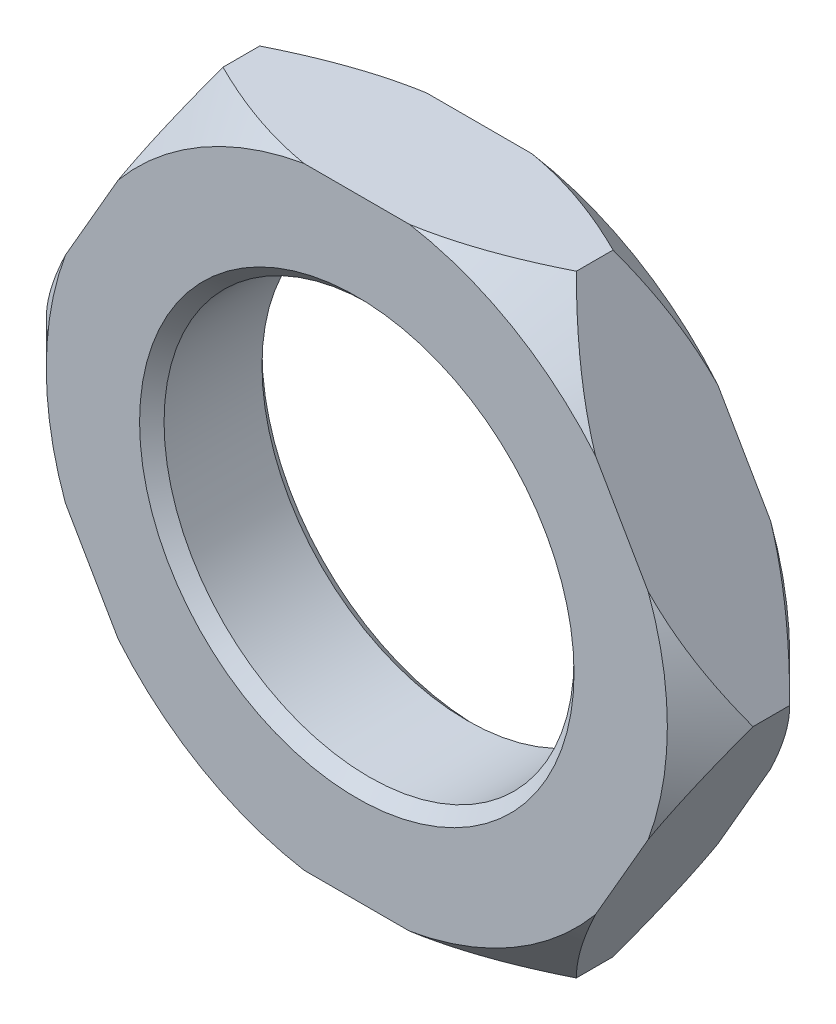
from build123d import *

# Parameters (mm, degrees)
ESQUISSE1_R             = 5.775
ESQUISSE1_R_2           = 3.35
BOSS_EXTRU_1_DEPTH      = 2
CHANFREIN1_SIZE         = 0.7
CHANFREIN2_SIZE         = 0.2
ENL_V_MAT_EXTRU_1_DEPTH = 2


with BuildPart() as part:
    # Esquisse1 → Boss.-Extru.1 (new body)
    with BuildSketch(Plane.XY):
        Circle(ESQUISSE1_R)
        Circle(ESQUISSE1_R_2, mode=Mode.SUBTRACT)
    extrude(amount=-BOSS_EXTRU_1_DEPTH)

    # Chanfrein1
    chanfrein1_edges = [part.edges().sort_by_distance(p)[0] for p in [
        (-5.775, 0, 0),
        (-5.775, 0, -2),
    ]]
    chamfer(chanfrein1_edges, length=CHANFREIN1_SIZE)

    # Chanfrein2
    chanfrein2_edges = [part.edges().sort_by_distance(p)[0] for p in [
        (-3.35, 0, -2),
        (-3.35, 0, 0),
    ]]
    chamfer(chanfrein2_edges, length=CHANFREIN2_SIZE)

    # Esquisse2 → Enl_v. mat.-Extru.1 (cut)
    with BuildSketch(Plane.XY):
        with BuildLine():
            ThreePointArc((2.8875, -5.001296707), (5.001296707, -2.8875), (5.775, 0))
            Line((5.775, 0), (2.8875, -5.001296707))
        make_face()
        with BuildLine():
            Line((2.8875, 5.001296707), (5.775, 0))
            ThreePointArc((5.775, 0), (5.001296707, 2.8875), (2.8875, 5.001296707))
        make_face()
        with BuildLine():
            Line((-2.8875, 5.001296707), (2.8875, 5.001296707))
            ThreePointArc((2.8875, 5.001296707), (0, 5.775), (-2.8875, 5.001296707))
        make_face()
        with BuildLine():
            ThreePointArc((-2.8875, -5.001296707), (0, -5.775), (2.8875, -5.001296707))
            Line((2.8875, -5.001296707), (-2.8875, -5.001296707))
        make_face()
        with BuildLine():
            Line((-5.775, 0), (-2.8875, 5.001296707))
            ThreePointArc((-2.8875, 5.001296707), (-5.001296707, 2.8875), (-5.775, 0))
        make_face()
        with BuildLine():
            ThreePointArc((-5.775, 0), (-5.001296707, -2.8875), (-2.8875, -5.001296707))
            Line((-2.8875, -5.001296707), (-5.775, 0))
        make_face()
    extrude(amount=-ENL_V_MAT_EXTRU_1_DEPTH, mode=Mode.SUBTRACT)


solid = part.part
